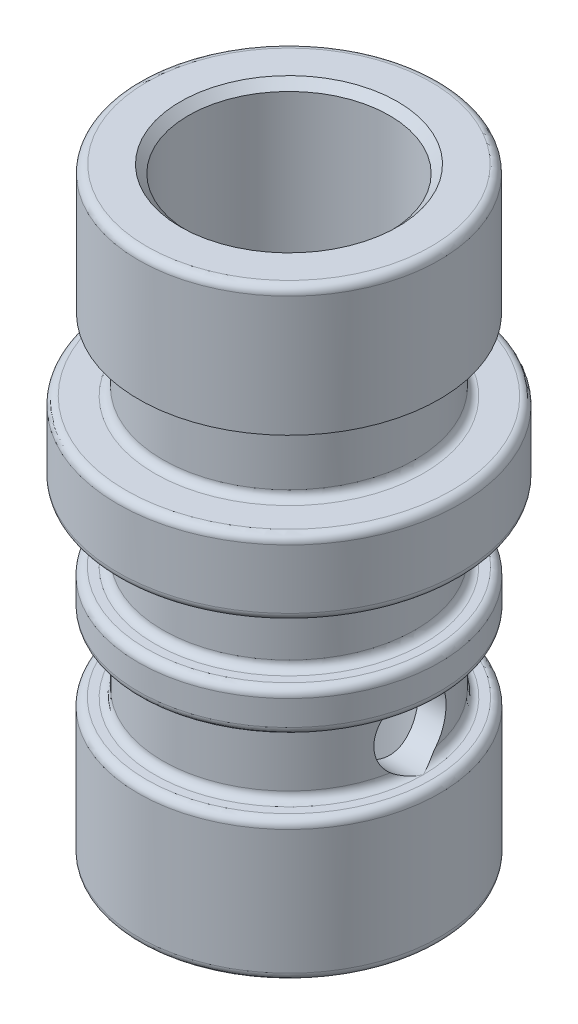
from build123d import *

# Parameters (mm, degrees)
SKETCH2_R           = 6.3627
EXTRUDE1_DEPTH      = 42.064852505
CHAMFER1_SIZE       = 0.508
FILLET1_R           = 0.508
EXTRUDE2_DEPTH      = 42.064852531
EXTRUDE2_DEPTH_BACK = 42.064852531
SKETCH3_R           = 2.286


with BuildPart() as part:
    # Sketch1 → Revolve1 (revolve)
    with BuildSketch(Plane.XY, mode=Mode.PRIVATE) as revolve1_sk:
        Polygon((9.53135, 0), (9.53135, 8.89), (7.9883, 8.89), (7.9883, 13.462), (9.53135, 13.462), (9.53135, 16.0655), (7.9883, 16.0655), (7.9883, 20.6375), (10.8331, 20.6375), (10.8331, 25.4), (7.9883, 25.4), (7.9883, 29.972), (9.5123, 29.972), (9.5123, 38.1), (0, 38.1), (0, 0), align=None)
    revolve(revolve1_sk.sketch.rotate(Axis((0, 0, 0), (0, 1, 0)), 90), axis=Axis((0, 0, 0), (0, 1, 0)))

    # Sketch2 → Extrude1 (cut, through all)
    with BuildSketch(Plane(origin=(0, 38.1, 0), x_dir=(1, 0, 0), z_dir=(0, 1, 0))):
        with Locations(Location((0, 0, 0), (0, 0, 270))):
            Circle(SKETCH2_R)
    extrude(amount=-EXTRUDE1_DEPTH, mode=Mode.SUBTRACT)

    # Chamfer1
    chamfer1_edges = [part.edges().sort_by_distance(p)[0] for p in [
        (0, 38.1, -6.3627),
    ]]
    chamfer(chamfer1_edges, length=CHAMFER1_SIZE)

    # Fillet1
    fillet1_edges = [part.edges().sort_by_distance(p)[0] for p in [
        (0, 38.1, 9.5123),
        (0, 29.972, 7.9883),
        (0, 25.4, 7.9883),
        (0, 25.4, 10.8331),
        (0, 20.6375, 10.8331),
        (0, 20.6375, 7.9883),
        (0, 16.0655, 7.9883),
        (0, 16.0655, 9.53135),
        (0, 13.462, 9.53135),
        (0, 13.462, 7.9883),
        (0, 8.89, 7.9883),
        (0, 8.89, 9.53135),
        (0, 0, 9.53135),
        (0, 0, -6.3627),
    ]]
    fillet(fillet1_edges, radius=FILLET1_R)

    # Sketch3 → Extrude2 (cut, two sides: drawn at the far end of the back side and taken through both)
    with BuildSketch(Plane(origin=(0, 0, 0), x_dir=(0, 0, -1), z_dir=(1, 0, 0)).offset(-EXTRUDE2_DEPTH_BACK)):
        with Locations((0, 11.176)):
            Circle(SKETCH3_R)
    extrude(amount=EXTRUDE2_DEPTH + EXTRUDE2_DEPTH_BACK, mode=Mode.SUBTRACT)


solid = part.part
